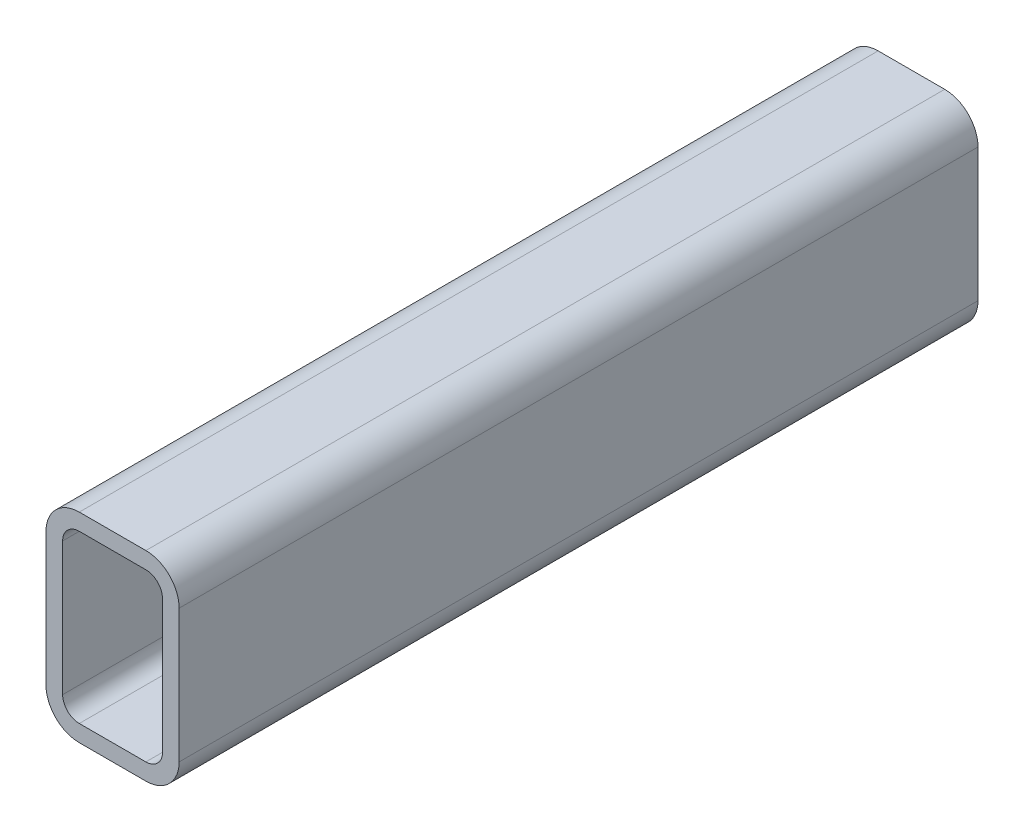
from build123d import *

# Parameters (mm, degrees)
BOSS_EXTRUDE1_DEPTH = 304.8


with BuildPart() as part:
    # Sketch1 → Boss-Extrude1 (new body)
    with BuildSketch(Plane.XY):
        with BuildLine():
            Line((12.7, 76.2), (38.1, 76.2))
            ThreePointArc((38.1, 76.2), (47.080256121, 72.480256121), (50.8, 63.5))
            Line((50.8, 63.5), (50.8, 12.7))
            ThreePointArc((50.8, 12.7), (47.080256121, 3.719743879), (38.1, 0))
            Line((38.1, 0), (12.7, 0))
            ThreePointArc((12.7, 0), (3.719743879, 3.719743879), (0, 12.7))
            Line((0, 12.7), (0, 63.5))
            ThreePointArc((0, 63.5), (3.719743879, 72.480256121), (12.7, 76.2))
        make_face()
        with BuildLine():
            Line((12.7, 69.85), (38.1, 69.85))
            ThreePointArc((38.1, 69.85), (42.590128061, 67.990128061), (44.45, 63.5))
            Line((44.45, 63.5), (44.45, 12.7))
            ThreePointArc((44.45, 12.7), (42.590128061, 8.209871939), (38.1, 6.35))
            Line((38.1, 6.35), (12.7, 6.35))
            ThreePointArc((12.7, 6.35), (8.209871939, 8.209871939), (6.35, 12.7))
            Line((6.35, 12.7), (6.35, 63.5))
            ThreePointArc((6.35, 63.5), (8.209871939, 67.990128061), (12.7, 69.85))
        make_face(mode=Mode.SUBTRACT)
    extrude(amount=BOSS_EXTRUDE1_DEPTH)


solid = part.part
